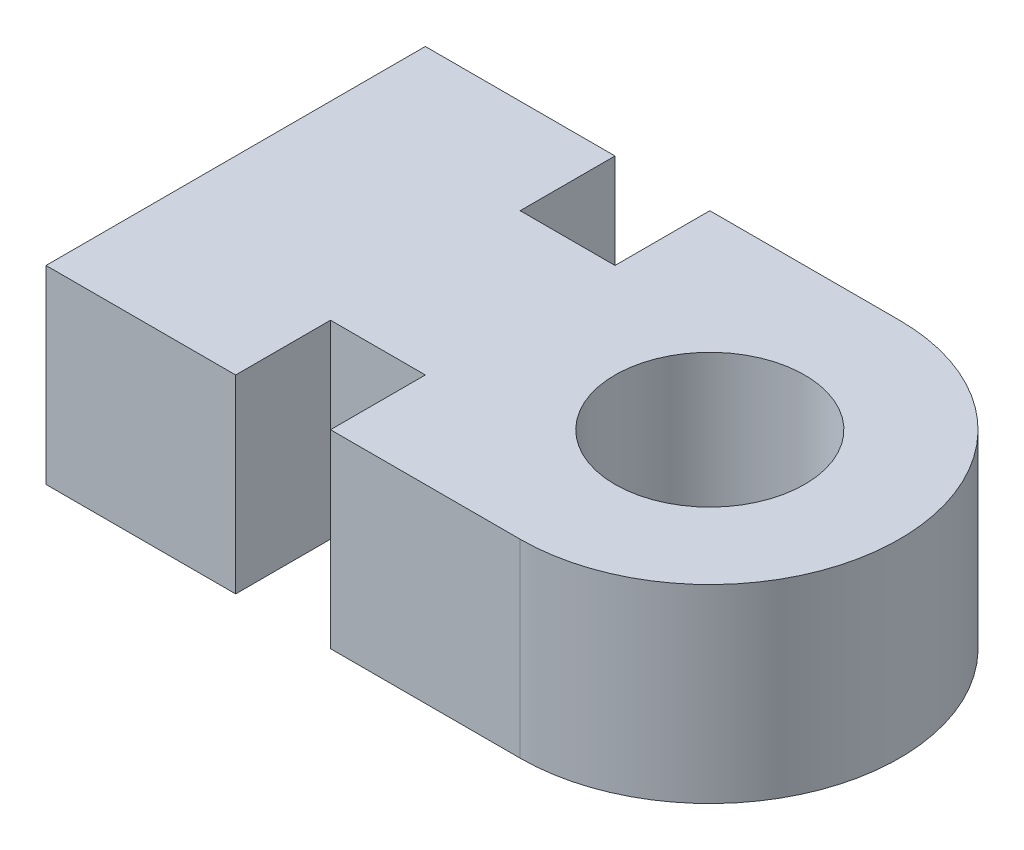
from build123d import *

# Parameters (mm, degrees)
SKETCH1_R      = 10
EXTRUDE1_DEPTH = 10


with BuildPart() as part:
    # Sketch1 → Extrude1 (new, symmetric)
    with BuildSketch(Plane(origin=(0, 0, 0), x_dir=(1, 0, 0), z_dir=(0, 1, 0))):
        with BuildLine():
            Line((0, 20), (-20, 20))
            Line((-20, 20), (-20, 10))
            Line((-20, 10), (-30, 10))
            Line((-30, 10), (-30, 20))
            Line((-30, 20), (-50, 20))
            Line((-50, 20), (-50, -20))
            Line((-50, -20), (-30, -20))
            Line((-30, -20), (-30, -10))
            Line((-30, -10), (-20, -10))
            Line((-20, -10), (-20, -20))
            Line((-20, -20), (0, -20))
            ThreePointArc((0, -20), (20, 0), (0, 20))
        make_face()
        with Locations(Location((0, 0, 0), (0, 0, 270))):
            Circle(SKETCH1_R, mode=Mode.SUBTRACT)
    extrude(amount=EXTRUDE1_DEPTH, both=True)


solid = part.part
